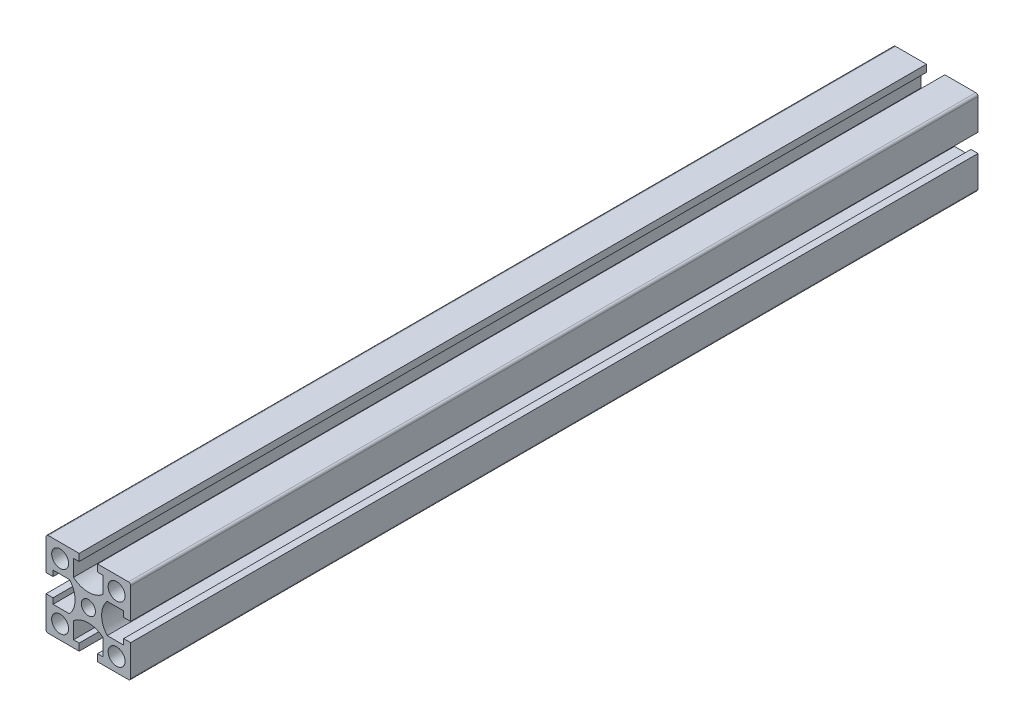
ISO-10303-21;
HEADER;
FILE_DESCRIPTION(('STEP AP214'),'2;1');
FILE_NAME('part.step','',(''),(''),'','','');
FILE_SCHEMA(('AUTOMOTIVE_DESIGN { 1 0 10303 214 1 1 1 1 }'));
ENDSEC;
DATA;
#1=APPLICATION_CONTEXT('core data for automotive mechanical design processes');
#2=APPLICATION_PROTOCOL_DEFINITION('international standard','automotive_design',2000,#1);
#3=PRODUCT_CONTEXT('',#1,'mechanical');
#4=PRODUCT('Part','Part','',(#3));
#5=PRODUCT_RELATED_PRODUCT_CATEGORY('part','',(#4));
#6=PRODUCT_DEFINITION_FORMATION('','',#4);
#7=PRODUCT_DEFINITION_CONTEXT('part definition',#1,'design');
#8=PRODUCT_DEFINITION('design','',#6,#7);
#9=PRODUCT_DEFINITION_SHAPE('','',#8);
#10=(LENGTH_UNIT() NAMED_UNIT(*) SI_UNIT(.MILLI.,.METRE.));
#11=(NAMED_UNIT(*) PLANE_ANGLE_UNIT() SI_UNIT($,.RADIAN.));
#12=(NAMED_UNIT(*) SI_UNIT($,.STERADIAN.) SOLID_ANGLE_UNIT());
#13=UNCERTAINTY_MEASURE_WITH_UNIT(LENGTH_MEASURE(1.E-05),#10,'distance_accuracy_value','');
#14=(GEOMETRIC_REPRESENTATION_CONTEXT(3) GLOBAL_UNCERTAINTY_ASSIGNED_CONTEXT((#13)) GLOBAL_UNIT_ASSIGNED_CONTEXT((#10,
#11,#12)) REPRESENTATION_CONTEXT('',''));
#15=CARTESIAN_POINT('',(0.,0.,0.));
#16=DIRECTION('',(0.,0.,1.));
#17=DIRECTION('',(1.,0.,0.));
#18=AXIS2_PLACEMENT_3D('',#15,#16,#17);
#19=CARTESIAN_POINT('',(-14.1999999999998,14.1999999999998,150.));
#20=DIRECTION('',(0.,0.,1.));
#21=DIRECTION('',(1.,0.,0.));
#22=AXIS2_PLACEMENT_3D('',#19,#20,#21);
#23=PLANE('',#22);
#24=CARTESIAN_POINT('',(-10.,10.,150.));
#25=DIRECTION('',(0.,0.,1.));
#26=DIRECTION('',(1.,0.,0.));
#27=AXIS2_PLACEMENT_3D('',#24,#25,#26);
#28=CIRCLE('',#27,3.);
#29=CARTESIAN_POINT('',(-7.,10.,150.));
#30=VERTEX_POINT('',#29);
#31=EDGE_CURVE('E661',#30,#30,#28,.T.);
#32=ORIENTED_EDGE('',*,*,#31,.F.);
#33=EDGE_LOOP('',(#32));
#34=FACE_BOUND('',#33,.T.);
#35=CARTESIAN_POINT('',(10.,10.,150.));
#36=DIRECTION('',(0.,0.,1.));
#37=DIRECTION('',(1.,0.,0.));
#38=AXIS2_PLACEMENT_3D('',#35,#36,#37);
#39=CIRCLE('',#38,3.);
#40=CARTESIAN_POINT('',(13.,10.,150.));
#41=VERTEX_POINT('',#40);
#42=EDGE_CURVE('E674',#41,#41,#39,.T.);
#43=ORIENTED_EDGE('',*,*,#42,.F.);
#44=EDGE_LOOP('',(#43));
#45=FACE_BOUND('',#44,.T.);
#46=CARTESIAN_POINT('',(-14.1999999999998,14.1999999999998,150.));
#47=DIRECTION('',(0.,0.,1.));
#48=DIRECTION('',(1.,0.,0.));
#49=AXIS2_PLACEMENT_3D('',#46,#47,#48);
#50=CIRCLE('',#49,0.800000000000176);
#51=CARTESIAN_POINT('',(-14.1999999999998,15.,150.));
#52=VERTEX_POINT('',#51);
#53=CARTESIAN_POINT('',(-15.,14.1999999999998,150.));
#54=VERTEX_POINT('',#53);
#55=EDGE_CURVE('E403',#52,#54,#50,.T.);
#56=ORIENTED_EDGE('',*,*,#55,.T.);
#57=DIRECTION('',(0.,-1.,0.));
#58=VECTOR('',#57,1.);
#59=CARTESIAN_POINT('',(-15.,14.1999999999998,150.));
#60=LINE('',#59,#58);
#61=CARTESIAN_POINT('',(-15.,3.25,150.));
#62=VERTEX_POINT('',#61);
#63=EDGE_CURVE('E191',#54,#62,#60,.T.);
#64=ORIENTED_EDGE('',*,*,#63,.T.);
#65=DIRECTION('',(1.,0.,0.));
#66=VECTOR('',#65,1.);
#67=CARTESIAN_POINT('',(-15.,3.25,150.));
#68=LINE('',#67,#66);
#69=CARTESIAN_POINT('',(-12.5,3.25,150.));
#70=VERTEX_POINT('',#69);
#71=EDGE_CURVE('E514',#62,#70,#68,.T.);
#72=ORIENTED_EDGE('',*,*,#71,.T.);
#73=DIRECTION('',(0.,1.,0.));
#74=VECTOR('',#73,1.);
#75=CARTESIAN_POINT('',(-12.5,3.25,150.));
#76=LINE('',#75,#74);
#77=CARTESIAN_POINT('',(-12.5,5.25,150.));
#78=VERTEX_POINT('',#77);
#79=EDGE_CURVE('E533',#70,#78,#76,.T.);
#80=ORIENTED_EDGE('',*,*,#79,.T.);
#81=DIRECTION('',(1.,0.,0.));
#82=VECTOR('',#81,1.);
#83=CARTESIAN_POINT('',(-12.5,5.25,150.));
#84=LINE('',#83,#82);
#85=CARTESIAN_POINT('',(-6.66365176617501,5.25,150.));
#86=VERTEX_POINT('',#85);
#87=EDGE_CURVE('E530',#78,#86,#84,.T.);
#88=ORIENTED_EDGE('',*,*,#87,.T.);
#89=CARTESIAN_POINT('',(-12.6999999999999,0.,150.));
#90=DIRECTION('',(0.,0.,-1.));
#91=DIRECTION('',(1.,0.,0.));
#92=AXIS2_PLACEMENT_3D('',#89,#90,#91);
#93=CIRCLE('',#92,8.00000000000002);
#94=CARTESIAN_POINT('',(-6.66365176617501,-5.25,150.));
#95=VERTEX_POINT('',#94);
#96=EDGE_CURVE('E532',#86,#95,#93,.T.);
#97=ORIENTED_EDGE('',*,*,#96,.T.);
#98=DIRECTION('',(-1.,0.,0.));
#99=VECTOR('',#98,1.);
#100=CARTESIAN_POINT('',(-6.66365176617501,-5.25,150.));
#101=LINE('',#100,#99);
#102=CARTESIAN_POINT('',(-12.5,-5.25,150.));
#103=VERTEX_POINT('',#102);
#104=EDGE_CURVE('E535',#95,#103,#101,.T.);
#105=ORIENTED_EDGE('',*,*,#104,.T.);
#106=DIRECTION('',(0.,1.,0.));
#107=VECTOR('',#106,1.);
#108=CARTESIAN_POINT('',(-12.5,-5.25,150.));
#109=LINE('',#108,#107);
#110=CARTESIAN_POINT('',(-12.5,-3.25,150.));
#111=VERTEX_POINT('',#110);
#112=EDGE_CURVE('E541',#103,#111,#109,.T.);
#113=ORIENTED_EDGE('',*,*,#112,.T.);
#114=DIRECTION('',(-1.,0.,0.));
#115=VECTOR('',#114,1.);
#116=CARTESIAN_POINT('',(-12.5,-3.25,150.));
#117=LINE('',#116,#115);
#118=CARTESIAN_POINT('',(-15.,-3.25,150.));
#119=VERTEX_POINT('',#118);
#120=EDGE_CURVE('E543',#111,#119,#117,.T.);
#121=ORIENTED_EDGE('',*,*,#120,.T.);
#122=DIRECTION('',(0.,-1.,0.));
#123=VECTOR('',#122,1.);
#124=CARTESIAN_POINT('',(-15.,-3.25,150.));
#125=LINE('',#124,#123);
#126=CARTESIAN_POINT('',(-15.,-14.2000000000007,150.));
#127=VERTEX_POINT('',#126);
#128=EDGE_CURVE('E545',#119,#127,#125,.T.);
#129=ORIENTED_EDGE('',*,*,#128,.T.);
#130=CARTESIAN_POINT('',(-14.2000000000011,-14.2000000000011,150.));
#131=DIRECTION('',(0.,0.,1.));
#132=DIRECTION('',(1.,0.,0.));
#133=AXIS2_PLACEMENT_3D('',#130,#131,#132);
#134=CIRCLE('',#133,0.799999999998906);
#135=CARTESIAN_POINT('',(-14.1999999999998,-15.,150.));
#136=VERTEX_POINT('',#135);
#137=EDGE_CURVE('E547',#127,#136,#134,.T.);
#138=ORIENTED_EDGE('',*,*,#137,.T.);
#139=DIRECTION('',(1.,0.,0.));
#140=VECTOR('',#139,1.);
#141=CARTESIAN_POINT('',(-14.1999999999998,-15.,150.));
#142=LINE('',#141,#140);
#143=CARTESIAN_POINT('',(-3.25,-15.,150.));
#144=VERTEX_POINT('',#143);
#145=EDGE_CURVE('E549',#136,#144,#142,.T.);
#146=ORIENTED_EDGE('',*,*,#145,.T.);
#147=DIRECTION('',(0.,1.,0.));
#148=VECTOR('',#147,1.);
#149=CARTESIAN_POINT('',(-3.25,-15.,150.));
#150=LINE('',#149,#148);
#151=CARTESIAN_POINT('',(-3.25,-12.5,150.));
#152=VERTEX_POINT('',#151);
#153=EDGE_CURVE('E551',#144,#152,#150,.T.);
#154=ORIENTED_EDGE('',*,*,#153,.T.);
#155=DIRECTION('',(-1.,0.,0.));
#156=VECTOR('',#155,1.);
#157=CARTESIAN_POINT('',(-3.25,-12.5,150.));
#158=LINE('',#157,#156);
#159=CARTESIAN_POINT('',(-5.25,-12.5,150.));
#160=VERTEX_POINT('',#159);
#161=EDGE_CURVE('E553',#152,#160,#158,.T.);
#162=ORIENTED_EDGE('',*,*,#161,.T.);
#163=DIRECTION('',(0.,1.,0.));
#164=VECTOR('',#163,1.);
#165=CARTESIAN_POINT('',(-5.25,-12.5,150.));
#166=LINE('',#165,#164);
#167=CARTESIAN_POINT('',(-5.25,-6.66365176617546,150.));
#168=VERTEX_POINT('',#167);
#169=EDGE_CURVE('E555',#160,#168,#166,.T.);
#170=ORIENTED_EDGE('',*,*,#169,.T.);
#171=CARTESIAN_POINT('',(0.,-12.7000000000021,150.));
#172=DIRECTION('',(0.,0.,-1.));
#173=DIRECTION('',(1.,0.,0.));
#174=AXIS2_PLACEMENT_3D('',#171,#172,#173);
#175=CIRCLE('',#174,8.00000000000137);
#176=CARTESIAN_POINT('',(5.25,-6.66365176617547,150.));
#177=VERTEX_POINT('',#176);
#178=EDGE_CURVE('E557',#168,#177,#175,.T.);
#179=ORIENTED_EDGE('',*,*,#178,.T.);
#180=DIRECTION('',(0.,-1.,0.));
#181=VECTOR('',#180,1.);
#182=CARTESIAN_POINT('',(5.25,-6.66365176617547,150.));
#183=LINE('',#182,#181);
#184=CARTESIAN_POINT('',(5.25,-12.5,150.));
#185=VERTEX_POINT('',#184);
#186=EDGE_CURVE('E559',#177,#185,#183,.T.);
#187=ORIENTED_EDGE('',*,*,#186,.T.);
#188=DIRECTION('',(-1.,0.,0.));
#189=VECTOR('',#188,1.);
#190=CARTESIAN_POINT('',(5.25,-12.5,150.));
#191=LINE('',#190,#189);
#192=CARTESIAN_POINT('',(3.25,-12.5,150.));
#193=VERTEX_POINT('',#192);
#194=EDGE_CURVE('E561',#185,#193,#191,.T.);
#195=ORIENTED_EDGE('',*,*,#194,.T.);
#196=DIRECTION('',(0.,-1.,0.));
#197=VECTOR('',#196,1.);
#198=CARTESIAN_POINT('',(3.25,-12.5,150.));
#199=LINE('',#198,#197);
#200=CARTESIAN_POINT('',(3.25,-15.,150.));
#201=VERTEX_POINT('',#200);
#202=EDGE_CURVE('E563',#193,#201,#199,.T.);
#203=ORIENTED_EDGE('',*,*,#202,.T.);
#204=DIRECTION('',(1.,0.,0.));
#205=VECTOR('',#204,1.);
#206=CARTESIAN_POINT('',(3.25,-15.,150.));
#207=LINE('',#206,#205);
#208=CARTESIAN_POINT('',(14.2000000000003,-15.,150.));
#209=VERTEX_POINT('',#208);
#210=EDGE_CURVE('E565',#201,#209,#207,.T.);
#211=ORIENTED_EDGE('',*,*,#210,.T.);
#212=CARTESIAN_POINT('',(14.2000000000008,-14.2000000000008,150.));
#213=DIRECTION('',(0.,0.,1.));
#214=DIRECTION('',(1.,0.,0.));
#215=AXIS2_PLACEMENT_3D('',#212,#213,#214);
#216=CIRCLE('',#215,0.799999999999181);
#217=CARTESIAN_POINT('',(15.,-14.1999999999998,150.));
#218=VERTEX_POINT('',#217);
#219=EDGE_CURVE('E567',#209,#218,#216,.T.);
#220=ORIENTED_EDGE('',*,*,#219,.T.);
#221=DIRECTION('',(0.,1.,0.));
#222=VECTOR('',#221,1.);
#223=CARTESIAN_POINT('',(15.,-14.1999999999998,150.));
#224=LINE('',#223,#222);
#225=CARTESIAN_POINT('',(15.,-3.25,150.));
#226=VERTEX_POINT('',#225);
#227=EDGE_CURVE('E569',#218,#226,#224,.T.);
#228=ORIENTED_EDGE('',*,*,#227,.T.);
#229=DIRECTION('',(-1.,0.,0.));
#230=VECTOR('',#229,1.);
#231=CARTESIAN_POINT('',(15.,-3.25,150.));
#232=LINE('',#231,#230);
#233=CARTESIAN_POINT('',(12.5,-3.25,150.));
#234=VERTEX_POINT('',#233);
#235=EDGE_CURVE('E571',#226,#234,#232,.T.);
#236=ORIENTED_EDGE('',*,*,#235,.T.);
#237=DIRECTION('',(0.,-1.,0.));
#238=VECTOR('',#237,1.);
#239=CARTESIAN_POINT('',(12.5,-3.25,150.));
#240=LINE('',#239,#238);
#241=CARTESIAN_POINT('',(12.5,-5.25,150.));
#242=VERTEX_POINT('',#241);
#243=EDGE_CURVE('E573',#234,#242,#240,.T.);
#244=ORIENTED_EDGE('',*,*,#243,.T.);
#245=DIRECTION('',(-1.,0.,0.));
#246=VECTOR('',#245,1.);
#247=CARTESIAN_POINT('',(12.5,-5.25,150.));
#248=LINE('',#247,#246);
#249=CARTESIAN_POINT('',(6.66365176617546,-5.25,150.));
#250=VERTEX_POINT('',#249);
#251=EDGE_CURVE('E575',#242,#250,#248,.T.);
#252=ORIENTED_EDGE('',*,*,#251,.T.);
#253=CARTESIAN_POINT('',(12.7000000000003,0.,150.));
#254=DIRECTION('',(0.,0.,-1.));
#255=DIRECTION('',(1.,0.,0.));
#256=AXIS2_PLACEMENT_3D('',#253,#254,#255);
#257=CIRCLE('',#256,8.00000000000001);
#258=CARTESIAN_POINT('',(6.66365176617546,5.25,150.));
#259=VERTEX_POINT('',#258);
#260=EDGE_CURVE('E577',#250,#259,#257,.T.);
#261=ORIENTED_EDGE('',*,*,#260,.T.);
#262=DIRECTION('',(1.,0.,0.));
#263=VECTOR('',#262,1.);
#264=CARTESIAN_POINT('',(6.66365176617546,5.25,150.));
#265=LINE('',#264,#263);
#266=CARTESIAN_POINT('',(12.5,5.25,150.));
#267=VERTEX_POINT('',#266);
#268=EDGE_CURVE('E579',#259,#267,#265,.T.);
#269=ORIENTED_EDGE('',*,*,#268,.T.);
#270=DIRECTION('',(0.,-1.,0.));
#271=VECTOR('',#270,1.);
#272=CARTESIAN_POINT('',(12.5,5.25,150.));
#273=LINE('',#272,#271);
#274=CARTESIAN_POINT('',(12.5,3.25,150.));
#275=VERTEX_POINT('',#274);
#276=EDGE_CURVE('E581',#267,#275,#273,.T.);
#277=ORIENTED_EDGE('',*,*,#276,.T.);
#278=DIRECTION('',(1.,0.,0.));
#279=VECTOR('',#278,1.);
#280=CARTESIAN_POINT('',(12.5,3.25,150.));
#281=LINE('',#280,#279);
#282=CARTESIAN_POINT('',(15.,3.25,150.));
#283=VERTEX_POINT('',#282);
#284=EDGE_CURVE('E583',#275,#283,#281,.T.);
#285=ORIENTED_EDGE('',*,*,#284,.T.);
#286=DIRECTION('',(0.,1.,0.));
#287=VECTOR('',#286,1.);
#288=CARTESIAN_POINT('',(15.,3.25,150.));
#289=LINE('',#288,#287);
#290=CARTESIAN_POINT('',(15.,14.1999999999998,150.));
#291=VERTEX_POINT('',#290);
#292=EDGE_CURVE('E585',#283,#291,#289,.T.);
#293=ORIENTED_EDGE('',*,*,#292,.T.);
#294=CARTESIAN_POINT('',(14.1999999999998,14.1999999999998,150.));
#295=DIRECTION('',(0.,0.,1.));
#296=DIRECTION('',(1.,0.,0.));
#297=AXIS2_PLACEMENT_3D('',#294,#295,#296);
#298=CIRCLE('',#297,0.800000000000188);
#299=CARTESIAN_POINT('',(14.1999999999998,15.,150.));
#300=VERTEX_POINT('',#299);
#301=EDGE_CURVE('E587',#291,#300,#298,.T.);
#302=ORIENTED_EDGE('',*,*,#301,.T.);
#303=DIRECTION('',(-1.,0.,0.));
#304=VECTOR('',#303,1.);
#305=CARTESIAN_POINT('',(14.1999999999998,15.,150.));
#306=LINE('',#305,#304);
#307=CARTESIAN_POINT('',(3.25,15.,150.));
#308=VERTEX_POINT('',#307);
#309=EDGE_CURVE('E589',#300,#308,#306,.T.);
#310=ORIENTED_EDGE('',*,*,#309,.T.);
#311=DIRECTION('',(0.,-1.,0.));
#312=VECTOR('',#311,1.);
#313=CARTESIAN_POINT('',(3.25,15.,150.));
#314=LINE('',#313,#312);
#315=CARTESIAN_POINT('',(3.25,12.5,150.));
#316=VERTEX_POINT('',#315);
#317=EDGE_CURVE('E591',#308,#316,#314,.T.);
#318=ORIENTED_EDGE('',*,*,#317,.T.);
#319=DIRECTION('',(1.,0.,0.));
#320=VECTOR('',#319,1.);
#321=CARTESIAN_POINT('',(3.25,12.5,150.));
#322=LINE('',#321,#320);
#323=CARTESIAN_POINT('',(5.25,12.5,150.));
#324=VERTEX_POINT('',#323);
#325=EDGE_CURVE('E593',#316,#324,#322,.T.);
#326=ORIENTED_EDGE('',*,*,#325,.T.);
#327=DIRECTION('',(0.,-1.,0.));
#328=VECTOR('',#327,1.);
#329=CARTESIAN_POINT('',(5.25,12.5,150.));
#330=LINE('',#329,#328);
#331=CARTESIAN_POINT('',(5.25,6.66365176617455,150.));
#332=VERTEX_POINT('',#331);
#333=EDGE_CURVE('E595',#324,#332,#330,.T.);
#334=ORIENTED_EDGE('',*,*,#333,.T.);
#335=CARTESIAN_POINT('',(0.,12.7000000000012,150.));
#336=DIRECTION('',(0.,0.,-1.));
#337=DIRECTION('',(1.,0.,0.));
#338=AXIS2_PLACEMENT_3D('',#335,#336,#337);
#339=CIRCLE('',#338,8.00000000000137);
#340=CARTESIAN_POINT('',(-5.25,6.66365176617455,150.));
#341=VERTEX_POINT('',#340);
#342=EDGE_CURVE('E597',#332,#341,#339,.T.);
#343=ORIENTED_EDGE('',*,*,#342,.T.);
#344=DIRECTION('',(0.,1.,0.));
#345=VECTOR('',#344,1.);
#346=CARTESIAN_POINT('',(-5.25,6.66365176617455,150.));
#347=LINE('',#346,#345);
#348=CARTESIAN_POINT('',(-5.25,12.5,150.));
#349=VERTEX_POINT('',#348);
#350=EDGE_CURVE('E306',#341,#349,#347,.T.);
#351=ORIENTED_EDGE('',*,*,#350,.T.);
#352=DIRECTION('',(1.,0.,0.));
#353=VECTOR('',#352,1.);
#354=CARTESIAN_POINT('',(-5.25,12.5,150.));
#355=LINE('',#354,#353);
#356=CARTESIAN_POINT('',(-3.25,12.5,150.));
#357=VERTEX_POINT('',#356);
#358=EDGE_CURVE('E300',#349,#357,#355,.T.);
#359=ORIENTED_EDGE('',*,*,#358,.T.);
#360=DIRECTION('',(0.,1.,0.));
#361=VECTOR('',#360,1.);
#362=CARTESIAN_POINT('',(-3.25,12.5,150.));
#363=LINE('',#362,#361);
#364=CARTESIAN_POINT('',(-3.25,15.,150.));
#365=VERTEX_POINT('',#364);
#366=EDGE_CURVE('E304',#357,#365,#363,.T.);
#367=ORIENTED_EDGE('',*,*,#366,.T.);
#368=DIRECTION('',(-1.,0.,0.));
#369=VECTOR('',#368,1.);
#370=CARTESIAN_POINT('',(-3.25,15.,150.));
#371=LINE('',#370,#369);
#372=EDGE_CURVE('E52',#365,#52,#371,.T.);
#373=ORIENTED_EDGE('',*,*,#372,.T.);
#374=EDGE_LOOP('',(#56,#64,#72,#80,#88,#97,#105,#113,#121,#129,#138,#146,#154,#162,#170,#179,
#187,#195,#203,#211,#220,#228,#236,#244,#252,#261,#269,#277,#285,#293,#302,#310,#318,#326,#334,
#343,#351,#359,#367,#373));
#375=FACE_BOUND('',#374,.T.);
#376=CARTESIAN_POINT('',(10.,-10.,150.));
#377=DIRECTION('',(0.,0.,1.));
#378=DIRECTION('',(1.,0.,0.));
#379=AXIS2_PLACEMENT_3D('',#376,#377,#378);
#380=CIRCLE('',#379,3.);
#381=CARTESIAN_POINT('',(13.,-10.,150.));
#382=VERTEX_POINT('',#381);
#383=EDGE_CURVE('E328',#382,#382,#380,.T.);
#384=ORIENTED_EDGE('',*,*,#383,.F.);
#385=EDGE_LOOP('',(#384));
#386=FACE_BOUND('',#385,.T.);
#387=CARTESIAN_POINT('',(-10.,-10.,150.));
#388=DIRECTION('',(0.,0.,1.));
#389=DIRECTION('',(1.,0.,0.));
#390=AXIS2_PLACEMENT_3D('',#387,#388,#389);
#391=CIRCLE('',#390,3.);
#392=CARTESIAN_POINT('',(-7.,-10.,150.));
#393=VERTEX_POINT('',#392);
#394=EDGE_CURVE('E668',#393,#393,#391,.T.);
#395=ORIENTED_EDGE('',*,*,#394,.F.);
#396=EDGE_LOOP('',(#395));
#397=FACE_BOUND('',#396,.T.);
#398=CARTESIAN_POINT('',(0.,0.,150.));
#399=DIRECTION('',(0.,0.,1.));
#400=DIRECTION('',(1.,0.,0.));
#401=AXIS2_PLACEMENT_3D('',#398,#399,#400);
#402=CIRCLE('',#401,2.5);
#403=CARTESIAN_POINT('',(2.5,0.,150.));
#404=VERTEX_POINT('',#403);
#405=EDGE_CURVE('E656',#404,#404,#402,.T.);
#406=ORIENTED_EDGE('',*,*,#405,.F.);
#407=EDGE_LOOP('',(#406));
#408=FACE_BOUND('',#407,.T.);
#409=ADVANCED_FACE('F35',(#34,#45,#375,#386,#397,#408),#23,.T.);
#410=CARTESIAN_POINT('',(-14.1999999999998,14.1999999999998,-150.));
#411=DIRECTION('',(0.,0.,1.));
#412=DIRECTION('',(1.,0.,0.));
#413=AXIS2_PLACEMENT_3D('',#410,#411,#412);
#414=PLANE('',#413);
#415=CARTESIAN_POINT('',(-10.,10.,-150.));
#416=DIRECTION('',(0.,0.,1.));
#417=DIRECTION('',(1.,0.,0.));
#418=AXIS2_PLACEMENT_3D('',#415,#416,#417);
#419=CIRCLE('',#418,3.);
#420=CARTESIAN_POINT('',(-7.,10.,-150.));
#421=VERTEX_POINT('',#420);
#422=EDGE_CURVE('E658',#421,#421,#419,.T.);
#423=ORIENTED_EDGE('',*,*,#422,.T.);
#424=EDGE_LOOP('',(#423));
#425=FACE_BOUND('',#424,.T.);
#426=CARTESIAN_POINT('',(10.,10.,-150.));
#427=DIRECTION('',(0.,0.,1.));
#428=DIRECTION('',(1.,0.,0.));
#429=AXIS2_PLACEMENT_3D('',#426,#427,#428);
#430=CIRCLE('',#429,3.);
#431=CARTESIAN_POINT('',(13.,10.,-150.));
#432=VERTEX_POINT('',#431);
#433=EDGE_CURVE('E671',#432,#432,#430,.T.);
#434=ORIENTED_EDGE('',*,*,#433,.T.);
#435=EDGE_LOOP('',(#434));
#436=FACE_BOUND('',#435,.T.);
#437=CARTESIAN_POINT('',(-14.1999999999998,14.1999999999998,-150.));
#438=DIRECTION('',(0.,0.,1.));
#439=DIRECTION('',(1.,0.,0.));
#440=AXIS2_PLACEMENT_3D('',#437,#438,#439);
#441=CIRCLE('',#440,0.800000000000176);
#442=CARTESIAN_POINT('',(-14.1999999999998,15.,-150.));
#443=VERTEX_POINT('',#442);
#444=CARTESIAN_POINT('',(-15.,14.1999999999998,-150.));
#445=VERTEX_POINT('',#444);
#446=EDGE_CURVE('E324',#443,#445,#441,.T.);
#447=ORIENTED_EDGE('',*,*,#446,.F.);
#448=DIRECTION('',(-1.,0.,0.));
#449=VECTOR('',#448,1.);
#450=CARTESIAN_POINT('',(-3.25,15.,-150.));
#451=LINE('',#450,#449);
#452=CARTESIAN_POINT('',(-3.25,15.,-150.));
#453=VERTEX_POINT('',#452);
#454=EDGE_CURVE('E183',#453,#443,#451,.T.);
#455=ORIENTED_EDGE('',*,*,#454,.F.);
#456=DIRECTION('',(0.,1.,0.));
#457=VECTOR('',#456,1.);
#458=CARTESIAN_POINT('',(-3.25,12.5,-150.));
#459=LINE('',#458,#457);
#460=CARTESIAN_POINT('',(-3.25,12.5,-150.));
#461=VERTEX_POINT('',#460);
#462=EDGE_CURVE('E177',#461,#453,#459,.T.);
#463=ORIENTED_EDGE('',*,*,#462,.F.);
#464=DIRECTION('',(1.,0.,0.));
#465=VECTOR('',#464,1.);
#466=CARTESIAN_POINT('',(-5.25,12.5,-150.));
#467=LINE('',#466,#465);
#468=CARTESIAN_POINT('',(-5.25,12.5,-150.));
#469=VERTEX_POINT('',#468);
#470=EDGE_CURVE('E314',#469,#461,#467,.T.);
#471=ORIENTED_EDGE('',*,*,#470,.F.);
#472=DIRECTION('',(0.,1.,0.));
#473=VECTOR('',#472,1.);
#474=CARTESIAN_POINT('',(-5.25,6.66365176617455,-150.));
#475=LINE('',#474,#473);
#476=CARTESIAN_POINT('',(-5.25,6.66365176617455,-150.));
#477=VERTEX_POINT('',#476);
#478=EDGE_CURVE('E398',#477,#469,#475,.T.);
#479=ORIENTED_EDGE('',*,*,#478,.F.);
#480=CARTESIAN_POINT('',(0.,12.7000000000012,-150.));
#481=DIRECTION('',(0.,0.,-1.));
#482=DIRECTION('',(1.,0.,0.));
#483=AXIS2_PLACEMENT_3D('',#480,#481,#482);
#484=CIRCLE('',#483,8.00000000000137);
#485=CARTESIAN_POINT('',(5.25,6.66365176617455,-150.));
#486=VERTEX_POINT('',#485);
#487=EDGE_CURVE('E396',#486,#477,#484,.T.);
#488=ORIENTED_EDGE('',*,*,#487,.F.);
#489=DIRECTION('',(0.,-1.,0.));
#490=VECTOR('',#489,1.);
#491=CARTESIAN_POINT('',(5.25,12.5,-150.));
#492=LINE('',#491,#490);
#493=CARTESIAN_POINT('',(5.25,12.5,-150.));
#494=VERTEX_POINT('',#493);
#495=EDGE_CURVE('E394',#494,#486,#492,.T.);
#496=ORIENTED_EDGE('',*,*,#495,.F.);
#497=DIRECTION('',(1.,0.,0.));
#498=VECTOR('',#497,1.);
#499=CARTESIAN_POINT('',(3.25,12.5,-150.));
#500=LINE('',#499,#498);
#501=CARTESIAN_POINT('',(3.25,12.5,-150.));
#502=VERTEX_POINT('',#501);
#503=EDGE_CURVE('E392',#502,#494,#500,.T.);
#504=ORIENTED_EDGE('',*,*,#503,.F.);
#505=DIRECTION('',(0.,-1.,0.));
#506=VECTOR('',#505,1.);
#507=CARTESIAN_POINT('',(3.25,15.,-150.));
#508=LINE('',#507,#506);
#509=CARTESIAN_POINT('',(3.25,15.,-150.));
#510=VERTEX_POINT('',#509);
#511=EDGE_CURVE('E390',#510,#502,#508,.T.);
#512=ORIENTED_EDGE('',*,*,#511,.F.);
#513=DIRECTION('',(-1.,0.,0.));
#514=VECTOR('',#513,1.);
#515=CARTESIAN_POINT('',(14.1999999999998,15.,-150.));
#516=LINE('',#515,#514);
#517=CARTESIAN_POINT('',(14.1999999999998,15.,-150.));
#518=VERTEX_POINT('',#517);
#519=EDGE_CURVE('E388',#518,#510,#516,.T.);
#520=ORIENTED_EDGE('',*,*,#519,.F.);
#521=CARTESIAN_POINT('',(14.1999999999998,14.1999999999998,-150.));
#522=DIRECTION('',(0.,0.,1.));
#523=DIRECTION('',(1.,0.,0.));
#524=AXIS2_PLACEMENT_3D('',#521,#522,#523);
#525=CIRCLE('',#524,0.800000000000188);
#526=CARTESIAN_POINT('',(15.,14.1999999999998,-150.));
#527=VERTEX_POINT('',#526);
#528=EDGE_CURVE('E386',#527,#518,#525,.T.);
#529=ORIENTED_EDGE('',*,*,#528,.F.);
#530=DIRECTION('',(0.,1.,0.));
#531=VECTOR('',#530,1.);
#532=CARTESIAN_POINT('',(15.,3.25,-150.));
#533=LINE('',#532,#531);
#534=CARTESIAN_POINT('',(15.,3.25,-150.));
#535=VERTEX_POINT('',#534);
#536=EDGE_CURVE('E384',#535,#527,#533,.T.);
#537=ORIENTED_EDGE('',*,*,#536,.F.);
#538=DIRECTION('',(1.,0.,0.));
#539=VECTOR('',#538,1.);
#540=CARTESIAN_POINT('',(12.5,3.25,-150.));
#541=LINE('',#540,#539);
#542=CARTESIAN_POINT('',(12.5,3.25,-150.));
#543=VERTEX_POINT('',#542);
#544=EDGE_CURVE('E382',#543,#535,#541,.T.);
#545=ORIENTED_EDGE('',*,*,#544,.F.);
#546=DIRECTION('',(0.,-1.,0.));
#547=VECTOR('',#546,1.);
#548=CARTESIAN_POINT('',(12.5,5.25,-150.));
#549=LINE('',#548,#547);
#550=CARTESIAN_POINT('',(12.5,5.25,-150.));
#551=VERTEX_POINT('',#550);
#552=EDGE_CURVE('E380',#551,#543,#549,.T.);
#553=ORIENTED_EDGE('',*,*,#552,.F.);
#554=DIRECTION('',(1.,0.,0.));
#555=VECTOR('',#554,1.);
#556=CARTESIAN_POINT('',(6.66365176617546,5.25,-150.));
#557=LINE('',#556,#555);
#558=CARTESIAN_POINT('',(6.66365176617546,5.25,-150.));
#559=VERTEX_POINT('',#558);
#560=EDGE_CURVE('E378',#559,#551,#557,.T.);
#561=ORIENTED_EDGE('',*,*,#560,.F.);
#562=CARTESIAN_POINT('',(12.7000000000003,0.,-150.));
#563=DIRECTION('',(0.,0.,-1.));
#564=DIRECTION('',(1.,0.,0.));
#565=AXIS2_PLACEMENT_3D('',#562,#563,#564);
#566=CIRCLE('',#565,8.00000000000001);
#567=CARTESIAN_POINT('',(6.66365176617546,-5.25,-150.));
#568=VERTEX_POINT('',#567);
#569=EDGE_CURVE('E376',#568,#559,#566,.T.);
#570=ORIENTED_EDGE('',*,*,#569,.F.);
#571=DIRECTION('',(-1.,0.,0.));
#572=VECTOR('',#571,1.);
#573=CARTESIAN_POINT('',(12.5,-5.25,-150.));
#574=LINE('',#573,#572);
#575=CARTESIAN_POINT('',(12.5,-5.25,-150.));
#576=VERTEX_POINT('',#575);
#577=EDGE_CURVE('E374',#576,#568,#574,.T.);
#578=ORIENTED_EDGE('',*,*,#577,.F.);
#579=DIRECTION('',(0.,-1.,0.));
#580=VECTOR('',#579,1.);
#581=CARTESIAN_POINT('',(12.5,-3.25,-150.));
#582=LINE('',#581,#580);
#583=CARTESIAN_POINT('',(12.5,-3.25,-150.));
#584=VERTEX_POINT('',#583);
#585=EDGE_CURVE('E372',#584,#576,#582,.T.);
#586=ORIENTED_EDGE('',*,*,#585,.F.);
#587=DIRECTION('',(-1.,0.,0.));
#588=VECTOR('',#587,1.);
#589=CARTESIAN_POINT('',(15.,-3.25,-150.));
#590=LINE('',#589,#588);
#591=CARTESIAN_POINT('',(15.,-3.25,-150.));
#592=VERTEX_POINT('',#591);
#593=EDGE_CURVE('E370',#592,#584,#590,.T.);
#594=ORIENTED_EDGE('',*,*,#593,.F.);
#595=DIRECTION('',(0.,1.,0.));
#596=VECTOR('',#595,1.);
#597=CARTESIAN_POINT('',(15.,-14.1999999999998,-150.));
#598=LINE('',#597,#596);
#599=CARTESIAN_POINT('',(15.,-14.1999999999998,-150.));
#600=VERTEX_POINT('',#599);
#601=EDGE_CURVE('E368',#600,#592,#598,.T.);
#602=ORIENTED_EDGE('',*,*,#601,.F.);
#603=CARTESIAN_POINT('',(14.2000000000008,-14.2000000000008,-150.));
#604=DIRECTION('',(0.,0.,1.));
#605=DIRECTION('',(1.,0.,0.));
#606=AXIS2_PLACEMENT_3D('',#603,#604,#605);
#607=CIRCLE('',#606,0.799999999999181);
#608=CARTESIAN_POINT('',(14.2000000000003,-15.,-150.));
#609=VERTEX_POINT('',#608);
#610=EDGE_CURVE('E366',#609,#600,#607,.T.);
#611=ORIENTED_EDGE('',*,*,#610,.F.);
#612=DIRECTION('',(1.,0.,0.));
#613=VECTOR('',#612,1.);
#614=CARTESIAN_POINT('',(3.25,-15.,-150.));
#615=LINE('',#614,#613);
#616=CARTESIAN_POINT('',(3.25,-15.,-150.));
#617=VERTEX_POINT('',#616);
#618=EDGE_CURVE('E364',#617,#609,#615,.T.);
#619=ORIENTED_EDGE('',*,*,#618,.F.);
#620=DIRECTION('',(0.,-1.,0.));
#621=VECTOR('',#620,1.);
#622=CARTESIAN_POINT('',(3.25,-12.5,-150.));
#623=LINE('',#622,#621);
#624=CARTESIAN_POINT('',(3.25,-12.5,-150.));
#625=VERTEX_POINT('',#624);
#626=EDGE_CURVE('E362',#625,#617,#623,.T.);
#627=ORIENTED_EDGE('',*,*,#626,.F.);
#628=DIRECTION('',(-1.,0.,0.));
#629=VECTOR('',#628,1.);
#630=CARTESIAN_POINT('',(5.25,-12.5,-150.));
#631=LINE('',#630,#629);
#632=CARTESIAN_POINT('',(5.25,-12.5,-150.));
#633=VERTEX_POINT('',#632);
#634=EDGE_CURVE('E360',#633,#625,#631,.T.);
#635=ORIENTED_EDGE('',*,*,#634,.F.);
#636=DIRECTION('',(0.,-1.,0.));
#637=VECTOR('',#636,1.);
#638=CARTESIAN_POINT('',(5.25,-6.66365176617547,-150.));
#639=LINE('',#638,#637);
#640=CARTESIAN_POINT('',(5.25,-6.66365176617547,-150.));
#641=VERTEX_POINT('',#640);
#642=EDGE_CURVE('E358',#641,#633,#639,.T.);
#643=ORIENTED_EDGE('',*,*,#642,.F.);
#644=CARTESIAN_POINT('',(0.,-12.7000000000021,-150.));
#645=DIRECTION('',(0.,0.,-1.));
#646=DIRECTION('',(1.,0.,0.));
#647=AXIS2_PLACEMENT_3D('',#644,#645,#646);
#648=CIRCLE('',#647,8.00000000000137);
#649=CARTESIAN_POINT('',(-5.25,-6.66365176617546,-150.));
#650=VERTEX_POINT('',#649);
#651=EDGE_CURVE('E356',#650,#641,#648,.T.);
#652=ORIENTED_EDGE('',*,*,#651,.F.);
#653=DIRECTION('',(0.,1.,0.));
#654=VECTOR('',#653,1.);
#655=CARTESIAN_POINT('',(-5.25,-12.5,-150.));
#656=LINE('',#655,#654);
#657=CARTESIAN_POINT('',(-5.25,-12.5,-150.));
#658=VERTEX_POINT('',#657);
#659=EDGE_CURVE('E354',#658,#650,#656,.T.);
#660=ORIENTED_EDGE('',*,*,#659,.F.);
#661=DIRECTION('',(-1.,0.,0.));
#662=VECTOR('',#661,1.);
#663=CARTESIAN_POINT('',(-3.25,-12.5,-150.));
#664=LINE('',#663,#662);
#665=CARTESIAN_POINT('',(-3.25,-12.5,-150.));
#666=VERTEX_POINT('',#665);
#667=EDGE_CURVE('E352',#666,#658,#664,.T.);
#668=ORIENTED_EDGE('',*,*,#667,.F.);
#669=DIRECTION('',(0.,1.,0.));
#670=VECTOR('',#669,1.);
#671=CARTESIAN_POINT('',(-3.25,-15.,-150.));
#672=LINE('',#671,#670);
#673=CARTESIAN_POINT('',(-3.25,-15.,-150.));
#674=VERTEX_POINT('',#673);
#675=EDGE_CURVE('E350',#674,#666,#672,.T.);
#676=ORIENTED_EDGE('',*,*,#675,.F.);
#677=DIRECTION('',(1.,0.,0.));
#678=VECTOR('',#677,1.);
#679=CARTESIAN_POINT('',(-14.1999999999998,-15.,-150.));
#680=LINE('',#679,#678);
#681=CARTESIAN_POINT('',(-14.1999999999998,-15.,-150.));
#682=VERTEX_POINT('',#681);
#683=EDGE_CURVE('E348',#682,#674,#680,.T.);
#684=ORIENTED_EDGE('',*,*,#683,.F.);
#685=CARTESIAN_POINT('',(-14.2000000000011,-14.2000000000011,-150.));
#686=DIRECTION('',(0.,0.,1.));
#687=DIRECTION('',(1.,0.,0.));
#688=AXIS2_PLACEMENT_3D('',#685,#686,#687);
#689=CIRCLE('',#688,0.799999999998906);
#690=CARTESIAN_POINT('',(-15.,-14.2000000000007,-150.));
#691=VERTEX_POINT('',#690);
#692=EDGE_CURVE('E346',#691,#682,#689,.T.);
#693=ORIENTED_EDGE('',*,*,#692,.F.);
#694=DIRECTION('',(0.,-1.,0.));
#695=VECTOR('',#694,1.);
#696=CARTESIAN_POINT('',(-15.,-3.25,-150.));
#697=LINE('',#696,#695);
#698=CARTESIAN_POINT('',(-15.,-3.25,-150.));
#699=VERTEX_POINT('',#698);
#700=EDGE_CURVE('E344',#699,#691,#697,.T.);
#701=ORIENTED_EDGE('',*,*,#700,.F.);
#702=DIRECTION('',(-1.,0.,0.));
#703=VECTOR('',#702,1.);
#704=CARTESIAN_POINT('',(-12.5,-3.25,-150.));
#705=LINE('',#704,#703);
#706=CARTESIAN_POINT('',(-12.5,-3.25,-150.));
#707=VERTEX_POINT('',#706);
#708=EDGE_CURVE('E342',#707,#699,#705,.T.);
#709=ORIENTED_EDGE('',*,*,#708,.F.);
#710=DIRECTION('',(0.,1.,0.));
#711=VECTOR('',#710,1.);
#712=CARTESIAN_POINT('',(-12.5,-5.25,-150.));
#713=LINE('',#712,#711);
#714=CARTESIAN_POINT('',(-12.5,-5.25,-150.));
#715=VERTEX_POINT('',#714);
#716=EDGE_CURVE('E340',#715,#707,#713,.T.);
#717=ORIENTED_EDGE('',*,*,#716,.F.);
#718=DIRECTION('',(-1.,0.,0.));
#719=VECTOR('',#718,1.);
#720=CARTESIAN_POINT('',(-6.66365176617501,-5.25,-150.));
#721=LINE('',#720,#719);
#722=CARTESIAN_POINT('',(-6.66365176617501,-5.25,-150.));
#723=VERTEX_POINT('',#722);
#724=EDGE_CURVE('E338',#723,#715,#721,.T.);
#725=ORIENTED_EDGE('',*,*,#724,.F.);
#726=CARTESIAN_POINT('',(-12.6999999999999,0.,-150.));
#727=DIRECTION('',(0.,0.,-1.));
#728=DIRECTION('',(1.,0.,0.));
#729=AXIS2_PLACEMENT_3D('',#726,#727,#728);
#730=CIRCLE('',#729,8.00000000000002);
#731=CARTESIAN_POINT('',(-6.66365176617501,5.25,-150.));
#732=VERTEX_POINT('',#731);
#733=EDGE_CURVE('E336',#732,#723,#730,.T.);
#734=ORIENTED_EDGE('',*,*,#733,.F.);
#735=DIRECTION('',(1.,0.,0.));
#736=VECTOR('',#735,1.);
#737=CARTESIAN_POINT('',(-12.5,5.25,-150.));
#738=LINE('',#737,#736);
#739=CARTESIAN_POINT('',(-12.5,5.25,-150.));
#740=VERTEX_POINT('',#739);
#741=EDGE_CURVE('E334',#740,#732,#738,.T.);
#742=ORIENTED_EDGE('',*,*,#741,.F.);
#743=DIRECTION('',(0.,1.,0.));
#744=VECTOR('',#743,1.);
#745=CARTESIAN_POINT('',(-12.5,3.25,-150.));
#746=LINE('',#745,#744);
#747=CARTESIAN_POINT('',(-12.5,3.25,-150.));
#748=VERTEX_POINT('',#747);
#749=EDGE_CURVE('E332',#748,#740,#746,.T.);
#750=ORIENTED_EDGE('',*,*,#749,.F.);
#751=DIRECTION('',(1.,0.,0.));
#752=VECTOR('',#751,1.);
#753=CARTESIAN_POINT('',(-15.,3.25,-150.));
#754=LINE('',#753,#752);
#755=CARTESIAN_POINT('',(-15.,3.25,-150.));
#756=VERTEX_POINT('',#755);
#757=EDGE_CURVE('E330',#756,#748,#754,.T.);
#758=ORIENTED_EDGE('',*,*,#757,.F.);
#759=DIRECTION('',(0.,-1.,0.));
#760=VECTOR('',#759,1.);
#761=CARTESIAN_POINT('',(-15.,14.1999999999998,-150.));
#762=LINE('',#761,#760);
#763=EDGE_CURVE('E327',#445,#756,#762,.T.);
#764=ORIENTED_EDGE('',*,*,#763,.F.);
#765=EDGE_LOOP('',(#447,#455,#463,#471,#479,#488,#496,#504,#512,#520,#529,#537,#545,#553,#561,
#570,#578,#586,#594,#602,#611,#619,#627,#635,#643,#652,#660,#668,#676,#684,#693,#701,#709,#717,
#725,#734,#742,#750,#758,#764));
#766=FACE_BOUND('',#765,.T.);
#767=CARTESIAN_POINT('',(10.,-10.,-150.));
#768=DIRECTION('',(0.,0.,1.));
#769=DIRECTION('',(1.,0.,0.));
#770=AXIS2_PLACEMENT_3D('',#767,#768,#769);
#771=CIRCLE('',#770,3.);
#772=CARTESIAN_POINT('',(13.,-10.,-150.));
#773=VERTEX_POINT('',#772);
#774=EDGE_CURVE('E677',#773,#773,#771,.T.);
#775=ORIENTED_EDGE('',*,*,#774,.T.);
#776=EDGE_LOOP('',(#775));
#777=FACE_BOUND('',#776,.T.);
#778=CARTESIAN_POINT('',(-10.,-10.,-150.));
#779=DIRECTION('',(0.,0.,1.));
#780=DIRECTION('',(1.,0.,0.));
#781=AXIS2_PLACEMENT_3D('',#778,#779,#780);
#782=CIRCLE('',#781,3.);
#783=CARTESIAN_POINT('',(-7.,-10.,-150.));
#784=VERTEX_POINT('',#783);
#785=EDGE_CURVE('E666',#784,#784,#782,.T.);
#786=ORIENTED_EDGE('',*,*,#785,.T.);
#787=EDGE_LOOP('',(#786));
#788=FACE_BOUND('',#787,.T.);
#789=CARTESIAN_POINT('',(0.,0.,-150.));
#790=DIRECTION('',(0.,0.,1.));
#791=DIRECTION('',(1.,0.,0.));
#792=AXIS2_PLACEMENT_3D('',#789,#790,#791);
#793=CIRCLE('',#792,2.5);
#794=CARTESIAN_POINT('',(2.5,0.,-150.));
#795=VERTEX_POINT('',#794);
#796=EDGE_CURVE('E653',#795,#795,#793,.T.);
#797=ORIENTED_EDGE('',*,*,#796,.T.);
#798=EDGE_LOOP('',(#797));
#799=FACE_BOUND('',#798,.T.);
#800=ADVANCED_FACE('F518',(#425,#436,#766,#777,#788,#799),#414,.F.);
#801=CARTESIAN_POINT('',(-14.1999999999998,14.1999999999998,150.));
#802=DIRECTION('',(0.,0.,-1.));
#803=DIRECTION('',(-1.,0.,0.));
#804=AXIS2_PLACEMENT_3D('',#801,#802,#803);
#805=CYLINDRICAL_SURFACE('',#804,0.800000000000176);
#806=ORIENTED_EDGE('',*,*,#446,.T.);
#807=DIRECTION('',(0.,0.,-1.));
#808=VECTOR('',#807,1.);
#809=CARTESIAN_POINT('',(-15.,14.1999999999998,150.));
#810=LINE('',#809,#808);
#811=EDGE_CURVE('E11',#54,#445,#810,.T.);
#812=ORIENTED_EDGE('',*,*,#811,.F.);
#813=ORIENTED_EDGE('',*,*,#55,.F.);
#814=DIRECTION('',(0.,0.,-1.));
#815=VECTOR('',#814,1.);
#816=CARTESIAN_POINT('',(-14.1999999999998,15.,150.));
#817=LINE('',#816,#815);
#818=EDGE_CURVE('E320',#52,#443,#817,.T.);
#819=ORIENTED_EDGE('',*,*,#818,.T.);
#820=EDGE_LOOP('',(#806,#812,#813,#819));
#821=FACE_BOUND('',#820,.T.);
#822=ADVANCED_FACE('F37',(#821),#805,.T.);
#823=CARTESIAN_POINT('',(-15.,14.1999999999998,150.));
#824=DIRECTION('',(1.,0.,0.));
#825=DIRECTION('',(0.,0.,-1.));
#826=AXIS2_PLACEMENT_3D('',#823,#824,#825);
#827=PLANE('',#826);
#828=ORIENTED_EDGE('',*,*,#763,.T.);
#829=DIRECTION('',(0.,0.,-1.));
#830=VECTOR('',#829,1.);
#831=CARTESIAN_POINT('',(-15.,3.25,150.));
#832=LINE('',#831,#830);
#833=EDGE_CURVE('E44',#62,#756,#832,.T.);
#834=ORIENTED_EDGE('',*,*,#833,.F.);
#835=ORIENTED_EDGE('',*,*,#63,.F.);
#836=ORIENTED_EDGE('',*,*,#811,.T.);
#837=EDGE_LOOP('',(#828,#834,#835,#836));
#838=FACE_BOUND('',#837,.T.);
#839=ADVANCED_FACE('F1077',(#838),#827,.F.);
#840=CARTESIAN_POINT('',(-15.,3.25,150.));
#841=DIRECTION('',(0.,1.,0.));
#842=DIRECTION('',(0.,0.,1.));
#843=AXIS2_PLACEMENT_3D('',#840,#841,#842);
#844=PLANE('',#843);
#845=ORIENTED_EDGE('',*,*,#757,.T.);
#846=DIRECTION('',(0.,0.,-1.));
#847=VECTOR('',#846,1.);
#848=CARTESIAN_POINT('',(-12.5,3.25,150.));
#849=LINE('',#848,#847);
#850=EDGE_CURVE('E506',#70,#748,#849,.T.);
#851=ORIENTED_EDGE('',*,*,#850,.F.);
#852=ORIENTED_EDGE('',*,*,#71,.F.);
#853=ORIENTED_EDGE('',*,*,#833,.T.);
#854=EDGE_LOOP('',(#845,#851,#852,#853));
#855=FACE_BOUND('',#854,.T.);
#856=ADVANCED_FACE('F512',(#855),#844,.F.);
#857=CARTESIAN_POINT('',(-12.5,3.25,150.));
#858=DIRECTION('',(-1.,0.,0.));
#859=DIRECTION('',(0.,0.,1.));
#860=AXIS2_PLACEMENT_3D('',#857,#858,#859);
#861=PLANE('',#860);
#862=ORIENTED_EDGE('',*,*,#749,.T.);
#863=DIRECTION('',(0.,0.,-1.));
#864=VECTOR('',#863,1.);
#865=CARTESIAN_POINT('',(-12.5,5.25,150.));
#866=LINE('',#865,#864);
#867=EDGE_CURVE('E503',#78,#740,#866,.T.);
#868=ORIENTED_EDGE('',*,*,#867,.F.);
#869=ORIENTED_EDGE('',*,*,#79,.F.);
#870=ORIENTED_EDGE('',*,*,#850,.T.);
#871=EDGE_LOOP('',(#862,#868,#869,#870));
#872=FACE_BOUND('',#871,.T.);
#873=ADVANCED_FACE('F524',(#872),#861,.F.);
#874=CARTESIAN_POINT('',(-12.5,5.25,150.));
#875=DIRECTION('',(0.,1.,0.));
#876=DIRECTION('',(0.,0.,1.));
#877=AXIS2_PLACEMENT_3D('',#874,#875,#876);
#878=PLANE('',#877);
#879=ORIENTED_EDGE('',*,*,#741,.T.);
#880=DIRECTION('',(0.,0.,-1.));
#881=VECTOR('',#880,1.);
#882=CARTESIAN_POINT('',(-6.66365176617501,5.25,150.));
#883=LINE('',#882,#881);
#884=EDGE_CURVE('E500',#86,#732,#883,.T.);
#885=ORIENTED_EDGE('',*,*,#884,.F.);
#886=ORIENTED_EDGE('',*,*,#87,.F.);
#887=ORIENTED_EDGE('',*,*,#867,.T.);
#888=EDGE_LOOP('',(#879,#885,#886,#887));
#889=FACE_BOUND('',#888,.T.);
#890=ADVANCED_FACE('F528',(#889),#878,.F.);
#891=CARTESIAN_POINT('',(-12.6999999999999,0.,150.));
#892=DIRECTION('',(0.,0.,-1.));
#893=DIRECTION('',(-1.,0.,0.));
#894=AXIS2_PLACEMENT_3D('',#891,#892,#893);
#895=CYLINDRICAL_SURFACE('',#894,8.00000000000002);
#896=ORIENTED_EDGE('',*,*,#733,.T.);
#897=DIRECTION('',(0.,0.,-1.));
#898=VECTOR('',#897,1.);
#899=CARTESIAN_POINT('',(-6.66365176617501,-5.25,150.));
#900=LINE('',#899,#898);
#901=EDGE_CURVE('E497',#95,#723,#900,.T.);
#902=ORIENTED_EDGE('',*,*,#901,.F.);
#903=ORIENTED_EDGE('',*,*,#96,.F.);
#904=ORIENTED_EDGE('',*,*,#884,.T.);
#905=EDGE_LOOP('',(#896,#902,#903,#904));
#906=FACE_BOUND('',#905,.T.);
#907=ADVANCED_FACE('F1042',(#906),#895,.F.);
#908=CARTESIAN_POINT('',(-6.66365176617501,-5.25,150.));
#909=DIRECTION('',(0.,-1.,0.));
#910=DIRECTION('',(0.,0.,-1.));
#911=AXIS2_PLACEMENT_3D('',#908,#909,#910);
#912=PLANE('',#911);
#913=ORIENTED_EDGE('',*,*,#724,.T.);
#914=DIRECTION('',(0.,0.,-1.));
#915=VECTOR('',#914,1.);
#916=CARTESIAN_POINT('',(-12.5,-5.25,150.));
#917=LINE('',#916,#915);
#918=EDGE_CURVE('E494',#103,#715,#917,.T.);
#919=ORIENTED_EDGE('',*,*,#918,.F.);
#920=ORIENTED_EDGE('',*,*,#104,.F.);
#921=ORIENTED_EDGE('',*,*,#901,.T.);
#922=EDGE_LOOP('',(#913,#919,#920,#921));
#923=FACE_BOUND('',#922,.T.);
#924=ADVANCED_FACE('F1032',(#923),#912,.F.);
#925=CARTESIAN_POINT('',(-12.5,-5.25,150.));
#926=DIRECTION('',(-1.,0.,0.));
#927=DIRECTION('',(0.,0.,1.));
#928=AXIS2_PLACEMENT_3D('',#925,#926,#927);
#929=PLANE('',#928);
#930=ORIENTED_EDGE('',*,*,#716,.T.);
#931=DIRECTION('',(0.,0.,-1.));
#932=VECTOR('',#931,1.);
#933=CARTESIAN_POINT('',(-12.5,-3.25,150.));
#934=LINE('',#933,#932);
#935=EDGE_CURVE('E491',#111,#707,#934,.T.);
#936=ORIENTED_EDGE('',*,*,#935,.F.);
#937=ORIENTED_EDGE('',*,*,#112,.F.);
#938=ORIENTED_EDGE('',*,*,#918,.T.);
#939=EDGE_LOOP('',(#930,#936,#937,#938));
#940=FACE_BOUND('',#939,.T.);
#941=ADVANCED_FACE('F1022',(#940),#929,.F.);
#942=CARTESIAN_POINT('',(-12.5,-3.25,150.));
#943=DIRECTION('',(0.,-1.,0.));
#944=DIRECTION('',(0.,0.,-1.));
#945=AXIS2_PLACEMENT_3D('',#942,#943,#944);
#946=PLANE('',#945);
#947=ORIENTED_EDGE('',*,*,#708,.T.);
#948=DIRECTION('',(0.,0.,-1.));
#949=VECTOR('',#948,1.);
#950=CARTESIAN_POINT('',(-15.,-3.25,150.));
#951=LINE('',#950,#949);
#952=EDGE_CURVE('E488',#119,#699,#951,.T.);
#953=ORIENTED_EDGE('',*,*,#952,.F.);
#954=ORIENTED_EDGE('',*,*,#120,.F.);
#955=ORIENTED_EDGE('',*,*,#935,.T.);
#956=EDGE_LOOP('',(#947,#953,#954,#955));
#957=FACE_BOUND('',#956,.T.);
#958=ADVANCED_FACE('F1012',(#957),#946,.F.);
#959=CARTESIAN_POINT('',(-15.,-3.25,150.));
#960=DIRECTION('',(1.,0.,0.));
#961=DIRECTION('',(0.,0.,-1.));
#962=AXIS2_PLACEMENT_3D('',#959,#960,#961);
#963=PLANE('',#962);
#964=ORIENTED_EDGE('',*,*,#700,.T.);
#965=DIRECTION('',(0.,0.,-1.));
#966=VECTOR('',#965,1.);
#967=CARTESIAN_POINT('',(-15.,-14.2000000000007,150.));
#968=LINE('',#967,#966);
#969=EDGE_CURVE('E485',#127,#691,#968,.T.);
#970=ORIENTED_EDGE('',*,*,#969,.F.);
#971=ORIENTED_EDGE('',*,*,#128,.F.);
#972=ORIENTED_EDGE('',*,*,#952,.T.);
#973=EDGE_LOOP('',(#964,#970,#971,#972));
#974=FACE_BOUND('',#973,.T.);
#975=ADVANCED_FACE('F1002',(#974),#963,.F.);
#976=CARTESIAN_POINT('',(-14.2000000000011,-14.2000000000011,150.));
#977=DIRECTION('',(0.,0.,-1.));
#978=DIRECTION('',(-1.,0.,0.));
#979=AXIS2_PLACEMENT_3D('',#976,#977,#978);
#980=CYLINDRICAL_SURFACE('',#979,0.799999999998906);
#981=ORIENTED_EDGE('',*,*,#692,.T.);
#982=DIRECTION('',(0.,0.,-1.));
#983=VECTOR('',#982,1.);
#984=CARTESIAN_POINT('',(-14.1999999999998,-15.,150.));
#985=LINE('',#984,#983);
#986=EDGE_CURVE('E482',#136,#682,#985,.T.);
#987=ORIENTED_EDGE('',*,*,#986,.F.);
#988=ORIENTED_EDGE('',*,*,#137,.F.);
#989=ORIENTED_EDGE('',*,*,#969,.T.);
#990=EDGE_LOOP('',(#981,#987,#988,#989));
#991=FACE_BOUND('',#990,.T.);
#992=ADVANCED_FACE('F992',(#991),#980,.T.);
#993=CARTESIAN_POINT('',(-14.1999999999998,-15.,150.));
#994=DIRECTION('',(0.,1.,0.));
#995=DIRECTION('',(0.,0.,1.));
#996=AXIS2_PLACEMENT_3D('',#993,#994,#995);
#997=PLANE('',#996);
#998=ORIENTED_EDGE('',*,*,#683,.T.);
#999=DIRECTION('',(0.,0.,-1.));
#1000=VECTOR('',#999,1.);
#1001=CARTESIAN_POINT('',(-3.25,-15.,150.));
#1002=LINE('',#1001,#1000);
#1003=EDGE_CURVE('E479',#144,#674,#1002,.T.);
#1004=ORIENTED_EDGE('',*,*,#1003,.F.);
#1005=ORIENTED_EDGE('',*,*,#145,.F.);
#1006=ORIENTED_EDGE('',*,*,#986,.T.);
#1007=EDGE_LOOP('',(#998,#1004,#1005,#1006));
#1008=FACE_BOUND('',#1007,.T.);
#1009=ADVANCED_FACE('F982',(#1008),#997,.F.);
#1010=CARTESIAN_POINT('',(-3.25,-15.,150.));
#1011=DIRECTION('',(-1.,0.,0.));
#1012=DIRECTION('',(0.,0.,1.));
#1013=AXIS2_PLACEMENT_3D('',#1010,#1011,#1012);
#1014=PLANE('',#1013);
#1015=ORIENTED_EDGE('',*,*,#675,.T.);
#1016=DIRECTION('',(0.,0.,-1.));
#1017=VECTOR('',#1016,1.);
#1018=CARTESIAN_POINT('',(-3.25,-12.5,150.));
#1019=LINE('',#1018,#1017);
#1020=EDGE_CURVE('E476',#152,#666,#1019,.T.);
#1021=ORIENTED_EDGE('',*,*,#1020,.F.);
#1022=ORIENTED_EDGE('',*,*,#153,.F.);
#1023=ORIENTED_EDGE('',*,*,#1003,.T.);
#1024=EDGE_LOOP('',(#1015,#1021,#1022,#1023));
#1025=FACE_BOUND('',#1024,.T.);
#1026=ADVANCED_FACE('F972',(#1025),#1014,.F.);
#1027=CARTESIAN_POINT('',(-3.25,-12.5,150.));
#1028=DIRECTION('',(0.,-1.,0.));
#1029=DIRECTION('',(0.,0.,-1.));
#1030=AXIS2_PLACEMENT_3D('',#1027,#1028,#1029);
#1031=PLANE('',#1030);
#1032=ORIENTED_EDGE('',*,*,#667,.T.);
#1033=DIRECTION('',(0.,0.,-1.));
#1034=VECTOR('',#1033,1.);
#1035=CARTESIAN_POINT('',(-5.25,-12.5,150.));
#1036=LINE('',#1035,#1034);
#1037=EDGE_CURVE('E473',#160,#658,#1036,.T.);
#1038=ORIENTED_EDGE('',*,*,#1037,.F.);
#1039=ORIENTED_EDGE('',*,*,#161,.F.);
#1040=ORIENTED_EDGE('',*,*,#1020,.T.);
#1041=EDGE_LOOP('',(#1032,#1038,#1039,#1040));
#1042=FACE_BOUND('',#1041,.T.);
#1043=ADVANCED_FACE('F962',(#1042),#1031,.F.);
#1044=CARTESIAN_POINT('',(-5.25,-12.5,150.));
#1045=DIRECTION('',(-1.,0.,0.));
#1046=DIRECTION('',(0.,0.,1.));
#1047=AXIS2_PLACEMENT_3D('',#1044,#1045,#1046);
#1048=PLANE('',#1047);
#1049=ORIENTED_EDGE('',*,*,#659,.T.);
#1050=DIRECTION('',(0.,0.,-1.));
#1051=VECTOR('',#1050,1.);
#1052=CARTESIAN_POINT('',(-5.25,-6.66365176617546,150.));
#1053=LINE('',#1052,#1051);
#1054=EDGE_CURVE('E470',#168,#650,#1053,.T.);
#1055=ORIENTED_EDGE('',*,*,#1054,.F.);
#1056=ORIENTED_EDGE('',*,*,#169,.F.);
#1057=ORIENTED_EDGE('',*,*,#1037,.T.);
#1058=EDGE_LOOP('',(#1049,#1055,#1056,#1057));
#1059=FACE_BOUND('',#1058,.T.);
#1060=ADVANCED_FACE('F952',(#1059),#1048,.F.);
#1061=CARTESIAN_POINT('',(0.,-12.7000000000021,150.));
#1062=DIRECTION('',(0.,0.,-1.));
#1063=DIRECTION('',(-1.,0.,0.));
#1064=AXIS2_PLACEMENT_3D('',#1061,#1062,#1063);
#1065=CYLINDRICAL_SURFACE('',#1064,8.00000000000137);
#1066=ORIENTED_EDGE('',*,*,#651,.T.);
#1067=DIRECTION('',(0.,0.,-1.));
#1068=VECTOR('',#1067,1.);
#1069=CARTESIAN_POINT('',(5.25,-6.66365176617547,150.));
#1070=LINE('',#1069,#1068);
#1071=EDGE_CURVE('E467',#177,#641,#1070,.T.);
#1072=ORIENTED_EDGE('',*,*,#1071,.F.);
#1073=ORIENTED_EDGE('',*,*,#178,.F.);
#1074=ORIENTED_EDGE('',*,*,#1054,.T.);
#1075=EDGE_LOOP('',(#1066,#1072,#1073,#1074));
#1076=FACE_BOUND('',#1075,.T.);
#1077=ADVANCED_FACE('F942',(#1076),#1065,.F.);
#1078=CARTESIAN_POINT('',(5.25,-6.66365176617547,150.));
#1079=DIRECTION('',(1.,0.,0.));
#1080=DIRECTION('',(0.,0.,-1.));
#1081=AXIS2_PLACEMENT_3D('',#1078,#1079,#1080);
#1082=PLANE('',#1081);
#1083=ORIENTED_EDGE('',*,*,#642,.T.);
#1084=DIRECTION('',(0.,0.,-1.));
#1085=VECTOR('',#1084,1.);
#1086=CARTESIAN_POINT('',(5.25,-12.5,150.));
#1087=LINE('',#1086,#1085);
#1088=EDGE_CURVE('E464',#185,#633,#1087,.T.);
#1089=ORIENTED_EDGE('',*,*,#1088,.F.);
#1090=ORIENTED_EDGE('',*,*,#186,.F.);
#1091=ORIENTED_EDGE('',*,*,#1071,.T.);
#1092=EDGE_LOOP('',(#1083,#1089,#1090,#1091));
#1093=FACE_BOUND('',#1092,.T.);
#1094=ADVANCED_FACE('F932',(#1093),#1082,.F.);
#1095=CARTESIAN_POINT('',(5.25,-12.5,150.));
#1096=DIRECTION('',(0.,-1.,0.));
#1097=DIRECTION('',(0.,0.,-1.));
#1098=AXIS2_PLACEMENT_3D('',#1095,#1096,#1097);
#1099=PLANE('',#1098);
#1100=ORIENTED_EDGE('',*,*,#634,.T.);
#1101=DIRECTION('',(0.,0.,-1.));
#1102=VECTOR('',#1101,1.);
#1103=CARTESIAN_POINT('',(3.25,-12.5,150.));
#1104=LINE('',#1103,#1102);
#1105=EDGE_CURVE('E461',#193,#625,#1104,.T.);
#1106=ORIENTED_EDGE('',*,*,#1105,.F.);
#1107=ORIENTED_EDGE('',*,*,#194,.F.);
#1108=ORIENTED_EDGE('',*,*,#1088,.T.);
#1109=EDGE_LOOP('',(#1100,#1106,#1107,#1108));
#1110=FACE_BOUND('',#1109,.T.);
#1111=ADVANCED_FACE('F922',(#1110),#1099,.F.);
#1112=CARTESIAN_POINT('',(3.25,-12.5,150.));
#1113=DIRECTION('',(1.,0.,0.));
#1114=DIRECTION('',(0.,0.,-1.));
#1115=AXIS2_PLACEMENT_3D('',#1112,#1113,#1114);
#1116=PLANE('',#1115);
#1117=ORIENTED_EDGE('',*,*,#626,.T.);
#1118=DIRECTION('',(0.,0.,-1.));
#1119=VECTOR('',#1118,1.);
#1120=CARTESIAN_POINT('',(3.25,-15.,150.));
#1121=LINE('',#1120,#1119);
#1122=EDGE_CURVE('E458',#201,#617,#1121,.T.);
#1123=ORIENTED_EDGE('',*,*,#1122,.F.);
#1124=ORIENTED_EDGE('',*,*,#202,.F.);
#1125=ORIENTED_EDGE('',*,*,#1105,.T.);
#1126=EDGE_LOOP('',(#1117,#1123,#1124,#1125));
#1127=FACE_BOUND('',#1126,.T.);
#1128=ADVANCED_FACE('F912',(#1127),#1116,.F.);
#1129=CARTESIAN_POINT('',(3.25,-15.,150.));
#1130=DIRECTION('',(0.,1.,0.));
#1131=DIRECTION('',(0.,0.,1.));
#1132=AXIS2_PLACEMENT_3D('',#1129,#1130,#1131);
#1133=PLANE('',#1132);
#1134=ORIENTED_EDGE('',*,*,#618,.T.);
#1135=DIRECTION('',(0.,0.,-1.));
#1136=VECTOR('',#1135,1.);
#1137=CARTESIAN_POINT('',(14.2000000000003,-15.,150.));
#1138=LINE('',#1137,#1136);
#1139=EDGE_CURVE('E455',#209,#609,#1138,.T.);
#1140=ORIENTED_EDGE('',*,*,#1139,.F.);
#1141=ORIENTED_EDGE('',*,*,#210,.F.);
#1142=ORIENTED_EDGE('',*,*,#1122,.T.);
#1143=EDGE_LOOP('',(#1134,#1140,#1141,#1142));
#1144=FACE_BOUND('',#1143,.T.);
#1145=ADVANCED_FACE('F902',(#1144),#1133,.F.);
#1146=CARTESIAN_POINT('',(14.2000000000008,-14.2000000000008,150.));
#1147=DIRECTION('',(0.,0.,-1.));
#1148=DIRECTION('',(-1.,0.,0.));
#1149=AXIS2_PLACEMENT_3D('',#1146,#1147,#1148);
#1150=CYLINDRICAL_SURFACE('',#1149,0.799999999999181);
#1151=ORIENTED_EDGE('',*,*,#610,.T.);
#1152=DIRECTION('',(0.,0.,-1.));
#1153=VECTOR('',#1152,1.);
#1154=CARTESIAN_POINT('',(15.,-14.1999999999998,150.));
#1155=LINE('',#1154,#1153);
#1156=EDGE_CURVE('E452',#218,#600,#1155,.T.);
#1157=ORIENTED_EDGE('',*,*,#1156,.F.);
#1158=ORIENTED_EDGE('',*,*,#219,.F.);
#1159=ORIENTED_EDGE('',*,*,#1139,.T.);
#1160=EDGE_LOOP('',(#1151,#1157,#1158,#1159));
#1161=FACE_BOUND('',#1160,.T.);
#1162=ADVANCED_FACE('F892',(#1161),#1150,.T.);
#1163=CARTESIAN_POINT('',(15.,-14.1999999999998,150.));
#1164=DIRECTION('',(-1.,0.,0.));
#1165=DIRECTION('',(0.,0.,1.));
#1166=AXIS2_PLACEMENT_3D('',#1163,#1164,#1165);
#1167=PLANE('',#1166);
#1168=ORIENTED_EDGE('',*,*,#601,.T.);
#1169=DIRECTION('',(0.,0.,-1.));
#1170=VECTOR('',#1169,1.);
#1171=CARTESIAN_POINT('',(15.,-3.25,150.));
#1172=LINE('',#1171,#1170);
#1173=EDGE_CURVE('E449',#226,#592,#1172,.T.);
#1174=ORIENTED_EDGE('',*,*,#1173,.F.);
#1175=ORIENTED_EDGE('',*,*,#227,.F.);
#1176=ORIENTED_EDGE('',*,*,#1156,.T.);
#1177=EDGE_LOOP('',(#1168,#1174,#1175,#1176));
#1178=FACE_BOUND('',#1177,.T.);
#1179=ADVANCED_FACE('F882',(#1178),#1167,.F.);
#1180=CARTESIAN_POINT('',(15.,-3.25,150.));
#1181=DIRECTION('',(0.,-1.,0.));
#1182=DIRECTION('',(0.,0.,-1.));
#1183=AXIS2_PLACEMENT_3D('',#1180,#1181,#1182);
#1184=PLANE('',#1183);
#1185=ORIENTED_EDGE('',*,*,#593,.T.);
#1186=DIRECTION('',(0.,0.,-1.));
#1187=VECTOR('',#1186,1.);
#1188=CARTESIAN_POINT('',(12.5,-3.25,150.));
#1189=LINE('',#1188,#1187);
#1190=EDGE_CURVE('E446',#234,#584,#1189,.T.);
#1191=ORIENTED_EDGE('',*,*,#1190,.F.);
#1192=ORIENTED_EDGE('',*,*,#235,.F.);
#1193=ORIENTED_EDGE('',*,*,#1173,.T.);
#1194=EDGE_LOOP('',(#1185,#1191,#1192,#1193));
#1195=FACE_BOUND('',#1194,.T.);
#1196=ADVANCED_FACE('F872',(#1195),#1184,.F.);
#1197=CARTESIAN_POINT('',(12.5,-3.25,150.));
#1198=DIRECTION('',(1.,0.,0.));
#1199=DIRECTION('',(0.,0.,-1.));
#1200=AXIS2_PLACEMENT_3D('',#1197,#1198,#1199);
#1201=PLANE('',#1200);
#1202=ORIENTED_EDGE('',*,*,#585,.T.);
#1203=DIRECTION('',(0.,0.,-1.));
#1204=VECTOR('',#1203,1.);
#1205=CARTESIAN_POINT('',(12.5,-5.25,150.));
#1206=LINE('',#1205,#1204);
#1207=EDGE_CURVE('E443',#242,#576,#1206,.T.);
#1208=ORIENTED_EDGE('',*,*,#1207,.F.);
#1209=ORIENTED_EDGE('',*,*,#243,.F.);
#1210=ORIENTED_EDGE('',*,*,#1190,.T.);
#1211=EDGE_LOOP('',(#1202,#1208,#1209,#1210));
#1212=FACE_BOUND('',#1211,.T.);
#1213=ADVANCED_FACE('F862',(#1212),#1201,.F.);
#1214=CARTESIAN_POINT('',(12.5,-5.25,150.));
#1215=DIRECTION('',(0.,-1.,0.));
#1216=DIRECTION('',(0.,0.,-1.));
#1217=AXIS2_PLACEMENT_3D('',#1214,#1215,#1216);
#1218=PLANE('',#1217);
#1219=ORIENTED_EDGE('',*,*,#577,.T.);
#1220=DIRECTION('',(0.,0.,-1.));
#1221=VECTOR('',#1220,1.);
#1222=CARTESIAN_POINT('',(6.66365176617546,-5.25,150.));
#1223=LINE('',#1222,#1221);
#1224=EDGE_CURVE('E440',#250,#568,#1223,.T.);
#1225=ORIENTED_EDGE('',*,*,#1224,.F.);
#1226=ORIENTED_EDGE('',*,*,#251,.F.);
#1227=ORIENTED_EDGE('',*,*,#1207,.T.);
#1228=EDGE_LOOP('',(#1219,#1225,#1226,#1227));
#1229=FACE_BOUND('',#1228,.T.);
#1230=ADVANCED_FACE('F852',(#1229),#1218,.F.);
#1231=CARTESIAN_POINT('',(12.7000000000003,0.,150.));
#1232=DIRECTION('',(0.,0.,-1.));
#1233=DIRECTION('',(-1.,0.,0.));
#1234=AXIS2_PLACEMENT_3D('',#1231,#1232,#1233);
#1235=CYLINDRICAL_SURFACE('',#1234,8.00000000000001);
#1236=ORIENTED_EDGE('',*,*,#569,.T.);
#1237=DIRECTION('',(0.,0.,-1.));
#1238=VECTOR('',#1237,1.);
#1239=CARTESIAN_POINT('',(6.66365176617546,5.25,150.));
#1240=LINE('',#1239,#1238);
#1241=EDGE_CURVE('E437',#259,#559,#1240,.T.);
#1242=ORIENTED_EDGE('',*,*,#1241,.F.);
#1243=ORIENTED_EDGE('',*,*,#260,.F.);
#1244=ORIENTED_EDGE('',*,*,#1224,.T.);
#1245=EDGE_LOOP('',(#1236,#1242,#1243,#1244));
#1246=FACE_BOUND('',#1245,.T.);
#1247=ADVANCED_FACE('F842',(#1246),#1235,.F.);
#1248=CARTESIAN_POINT('',(6.66365176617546,5.25,150.));
#1249=DIRECTION('',(0.,1.,0.));
#1250=DIRECTION('',(0.,0.,1.));
#1251=AXIS2_PLACEMENT_3D('',#1248,#1249,#1250);
#1252=PLANE('',#1251);
#1253=ORIENTED_EDGE('',*,*,#560,.T.);
#1254=DIRECTION('',(0.,0.,-1.));
#1255=VECTOR('',#1254,1.);
#1256=CARTESIAN_POINT('',(12.5,5.25,150.));
#1257=LINE('',#1256,#1255);
#1258=EDGE_CURVE('E434',#267,#551,#1257,.T.);
#1259=ORIENTED_EDGE('',*,*,#1258,.F.);
#1260=ORIENTED_EDGE('',*,*,#268,.F.);
#1261=ORIENTED_EDGE('',*,*,#1241,.T.);
#1262=EDGE_LOOP('',(#1253,#1259,#1260,#1261));
#1263=FACE_BOUND('',#1262,.T.);
#1264=ADVANCED_FACE('F832',(#1263),#1252,.F.);
#1265=CARTESIAN_POINT('',(12.5,5.25,150.));
#1266=DIRECTION('',(1.,0.,0.));
#1267=DIRECTION('',(0.,0.,-1.));
#1268=AXIS2_PLACEMENT_3D('',#1265,#1266,#1267);
#1269=PLANE('',#1268);
#1270=ORIENTED_EDGE('',*,*,#552,.T.);
#1271=DIRECTION('',(0.,0.,-1.));
#1272=VECTOR('',#1271,1.);
#1273=CARTESIAN_POINT('',(12.5,3.25,150.));
#1274=LINE('',#1273,#1272);
#1275=EDGE_CURVE('E431',#275,#543,#1274,.T.);
#1276=ORIENTED_EDGE('',*,*,#1275,.F.);
#1277=ORIENTED_EDGE('',*,*,#276,.F.);
#1278=ORIENTED_EDGE('',*,*,#1258,.T.);
#1279=EDGE_LOOP('',(#1270,#1276,#1277,#1278));
#1280=FACE_BOUND('',#1279,.T.);
#1281=ADVANCED_FACE('F822',(#1280),#1269,.F.);
#1282=CARTESIAN_POINT('',(12.5,3.25,150.));
#1283=DIRECTION('',(0.,1.,0.));
#1284=DIRECTION('',(0.,0.,1.));
#1285=AXIS2_PLACEMENT_3D('',#1282,#1283,#1284);
#1286=PLANE('',#1285);
#1287=ORIENTED_EDGE('',*,*,#544,.T.);
#1288=DIRECTION('',(0.,0.,-1.));
#1289=VECTOR('',#1288,1.);
#1290=CARTESIAN_POINT('',(15.,3.25,150.));
#1291=LINE('',#1290,#1289);
#1292=EDGE_CURVE('E428',#283,#535,#1291,.T.);
#1293=ORIENTED_EDGE('',*,*,#1292,.F.);
#1294=ORIENTED_EDGE('',*,*,#284,.F.);
#1295=ORIENTED_EDGE('',*,*,#1275,.T.);
#1296=EDGE_LOOP('',(#1287,#1293,#1294,#1295));
#1297=FACE_BOUND('',#1296,.T.);
#1298=ADVANCED_FACE('F812',(#1297),#1286,.F.);
#1299=CARTESIAN_POINT('',(15.,3.25,150.));
#1300=DIRECTION('',(-1.,0.,0.));
#1301=DIRECTION('',(0.,0.,1.));
#1302=AXIS2_PLACEMENT_3D('',#1299,#1300,#1301);
#1303=PLANE('',#1302);
#1304=ORIENTED_EDGE('',*,*,#536,.T.);
#1305=DIRECTION('',(0.,0.,-1.));
#1306=VECTOR('',#1305,1.);
#1307=CARTESIAN_POINT('',(15.,14.1999999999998,150.));
#1308=LINE('',#1307,#1306);
#1309=EDGE_CURVE('E425',#291,#527,#1308,.T.);
#1310=ORIENTED_EDGE('',*,*,#1309,.F.);
#1311=ORIENTED_EDGE('',*,*,#292,.F.);
#1312=ORIENTED_EDGE('',*,*,#1292,.T.);
#1313=EDGE_LOOP('',(#1304,#1310,#1311,#1312));
#1314=FACE_BOUND('',#1313,.T.);
#1315=ADVANCED_FACE('F802',(#1314),#1303,.F.);
#1316=CARTESIAN_POINT('',(14.1999999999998,14.1999999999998,150.));
#1317=DIRECTION('',(0.,0.,-1.));
#1318=DIRECTION('',(-1.,0.,0.));
#1319=AXIS2_PLACEMENT_3D('',#1316,#1317,#1318);
#1320=CYLINDRICAL_SURFACE('',#1319,0.800000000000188);
#1321=ORIENTED_EDGE('',*,*,#528,.T.);
#1322=DIRECTION('',(0.,0.,-1.));
#1323=VECTOR('',#1322,1.);
#1324=CARTESIAN_POINT('',(14.1999999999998,15.,150.));
#1325=LINE('',#1324,#1323);
#1326=EDGE_CURVE('E422',#300,#518,#1325,.T.);
#1327=ORIENTED_EDGE('',*,*,#1326,.F.);
#1328=ORIENTED_EDGE('',*,*,#301,.F.);
#1329=ORIENTED_EDGE('',*,*,#1309,.T.);
#1330=EDGE_LOOP('',(#1321,#1327,#1328,#1329));
#1331=FACE_BOUND('',#1330,.T.);
#1332=ADVANCED_FACE('F792',(#1331),#1320,.T.);
#1333=CARTESIAN_POINT('',(14.1999999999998,15.,150.));
#1334=DIRECTION('',(0.,-1.,0.));
#1335=DIRECTION('',(0.,0.,-1.));
#1336=AXIS2_PLACEMENT_3D('',#1333,#1334,#1335);
#1337=PLANE('',#1336);
#1338=ORIENTED_EDGE('',*,*,#519,.T.);
#1339=DIRECTION('',(0.,0.,-1.));
#1340=VECTOR('',#1339,1.);
#1341=CARTESIAN_POINT('',(3.25,15.,150.));
#1342=LINE('',#1341,#1340);
#1343=EDGE_CURVE('E419',#308,#510,#1342,.T.);
#1344=ORIENTED_EDGE('',*,*,#1343,.F.);
#1345=ORIENTED_EDGE('',*,*,#309,.F.);
#1346=ORIENTED_EDGE('',*,*,#1326,.T.);
#1347=EDGE_LOOP('',(#1338,#1344,#1345,#1346));
#1348=FACE_BOUND('',#1347,.T.);
#1349=ADVANCED_FACE('F782',(#1348),#1337,.F.);
#1350=CARTESIAN_POINT('',(3.25,15.,150.));
#1351=DIRECTION('',(1.,0.,0.));
#1352=DIRECTION('',(0.,0.,-1.));
#1353=AXIS2_PLACEMENT_3D('',#1350,#1351,#1352);
#1354=PLANE('',#1353);
#1355=ORIENTED_EDGE('',*,*,#511,.T.);
#1356=DIRECTION('',(0.,0.,-1.));
#1357=VECTOR('',#1356,1.);
#1358=CARTESIAN_POINT('',(3.25,12.5,150.));
#1359=LINE('',#1358,#1357);
#1360=EDGE_CURVE('E416',#316,#502,#1359,.T.);
#1361=ORIENTED_EDGE('',*,*,#1360,.F.);
#1362=ORIENTED_EDGE('',*,*,#317,.F.);
#1363=ORIENTED_EDGE('',*,*,#1343,.T.);
#1364=EDGE_LOOP('',(#1355,#1361,#1362,#1363));
#1365=FACE_BOUND('',#1364,.T.);
#1366=ADVANCED_FACE('F772',(#1365),#1354,.F.);
#1367=CARTESIAN_POINT('',(3.25,12.5,150.));
#1368=DIRECTION('',(0.,1.,0.));
#1369=DIRECTION('',(0.,0.,1.));
#1370=AXIS2_PLACEMENT_3D('',#1367,#1368,#1369);
#1371=PLANE('',#1370);
#1372=ORIENTED_EDGE('',*,*,#503,.T.);
#1373=DIRECTION('',(0.,0.,-1.));
#1374=VECTOR('',#1373,1.);
#1375=CARTESIAN_POINT('',(5.25,12.5,150.));
#1376=LINE('',#1375,#1374);
#1377=EDGE_CURVE('E413',#324,#494,#1376,.T.);
#1378=ORIENTED_EDGE('',*,*,#1377,.F.);
#1379=ORIENTED_EDGE('',*,*,#325,.F.);
#1380=ORIENTED_EDGE('',*,*,#1360,.T.);
#1381=EDGE_LOOP('',(#1372,#1378,#1379,#1380));
#1382=FACE_BOUND('',#1381,.T.);
#1383=ADVANCED_FACE('F762',(#1382),#1371,.F.);
#1384=CARTESIAN_POINT('',(5.25,12.5,150.));
#1385=DIRECTION('',(1.,0.,0.));
#1386=DIRECTION('',(0.,0.,-1.));
#1387=AXIS2_PLACEMENT_3D('',#1384,#1385,#1386);
#1388=PLANE('',#1387);
#1389=ORIENTED_EDGE('',*,*,#495,.T.);
#1390=DIRECTION('',(0.,0.,-1.));
#1391=VECTOR('',#1390,1.);
#1392=CARTESIAN_POINT('',(5.25,6.66365176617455,150.));
#1393=LINE('',#1392,#1391);
#1394=EDGE_CURVE('E410',#332,#486,#1393,.T.);
#1395=ORIENTED_EDGE('',*,*,#1394,.F.);
#1396=ORIENTED_EDGE('',*,*,#333,.F.);
#1397=ORIENTED_EDGE('',*,*,#1377,.T.);
#1398=EDGE_LOOP('',(#1389,#1395,#1396,#1397));
#1399=FACE_BOUND('',#1398,.T.);
#1400=ADVANCED_FACE('F753',(#1399),#1388,.F.);
#1401=CARTESIAN_POINT('',(0.,12.7000000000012,150.));
#1402=DIRECTION('',(0.,0.,-1.));
#1403=DIRECTION('',(-1.,0.,0.));
#1404=AXIS2_PLACEMENT_3D('',#1401,#1402,#1403);
#1405=CYLINDRICAL_SURFACE('',#1404,8.00000000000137);
#1406=ORIENTED_EDGE('',*,*,#487,.T.);
#1407=DIRECTION('',(0.,0.,-1.));
#1408=VECTOR('',#1407,1.);
#1409=CARTESIAN_POINT('',(-5.25,6.66365176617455,150.));
#1410=LINE('',#1409,#1408);
#1411=EDGE_CURVE('E407',#341,#477,#1410,.T.);
#1412=ORIENTED_EDGE('',*,*,#1411,.F.);
#1413=ORIENTED_EDGE('',*,*,#342,.F.);
#1414=ORIENTED_EDGE('',*,*,#1394,.T.);
#1415=EDGE_LOOP('',(#1406,#1412,#1413,#1414));
#1416=FACE_BOUND('',#1415,.T.);
#1417=ADVANCED_FACE('F603',(#1416),#1405,.F.);
#1418=CARTESIAN_POINT('',(-5.25,6.66365176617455,150.));
#1419=DIRECTION('',(-1.,0.,0.));
#1420=DIRECTION('',(0.,0.,1.));
#1421=AXIS2_PLACEMENT_3D('',#1418,#1419,#1420);
#1422=PLANE('',#1421);
#1423=ORIENTED_EDGE('',*,*,#478,.T.);
#1424=DIRECTION('',(0.,0.,-1.));
#1425=VECTOR('',#1424,1.);
#1426=CARTESIAN_POINT('',(-5.25,12.5,150.));
#1427=LINE('',#1426,#1425);
#1428=EDGE_CURVE('E315',#349,#469,#1427,.T.);
#1429=ORIENTED_EDGE('',*,*,#1428,.F.);
#1430=ORIENTED_EDGE('',*,*,#350,.F.);
#1431=ORIENTED_EDGE('',*,*,#1411,.T.);
#1432=EDGE_LOOP('',(#1423,#1429,#1430,#1431));
#1433=FACE_BOUND('',#1432,.T.);
#1434=ADVANCED_FACE('F607',(#1433),#1422,.F.);
#1435=CARTESIAN_POINT('',(-5.25,12.5,150.));
#1436=DIRECTION('',(0.,1.,0.));
#1437=DIRECTION('',(0.,0.,1.));
#1438=AXIS2_PLACEMENT_3D('',#1435,#1436,#1437);
#1439=PLANE('',#1438);
#1440=ORIENTED_EDGE('',*,*,#470,.T.);
#1441=DIRECTION('',(0.,0.,-1.));
#1442=VECTOR('',#1441,1.);
#1443=CARTESIAN_POINT('',(-3.25,12.5,150.));
#1444=LINE('',#1443,#1442);
#1445=EDGE_CURVE('E311',#357,#461,#1444,.T.);
#1446=ORIENTED_EDGE('',*,*,#1445,.F.);
#1447=ORIENTED_EDGE('',*,*,#358,.F.);
#1448=ORIENTED_EDGE('',*,*,#1428,.T.);
#1449=EDGE_LOOP('',(#1440,#1446,#1447,#1448));
#1450=FACE_BOUND('',#1449,.T.);
#1451=ADVANCED_FACE('F312',(#1450),#1439,.F.);
#1452=CARTESIAN_POINT('',(-3.25,12.5,150.));
#1453=DIRECTION('',(-1.,0.,0.));
#1454=DIRECTION('',(0.,0.,1.));
#1455=AXIS2_PLACEMENT_3D('',#1452,#1453,#1454);
#1456=PLANE('',#1455);
#1457=ORIENTED_EDGE('',*,*,#462,.T.);
#1458=DIRECTION('',(0.,0.,-1.));
#1459=VECTOR('',#1458,1.);
#1460=CARTESIAN_POINT('',(-3.25,15.,150.));
#1461=LINE('',#1460,#1459);
#1462=EDGE_CURVE('E316',#365,#453,#1461,.T.);
#1463=ORIENTED_EDGE('',*,*,#1462,.F.);
#1464=ORIENTED_EDGE('',*,*,#366,.F.);
#1465=ORIENTED_EDGE('',*,*,#1445,.T.);
#1466=EDGE_LOOP('',(#1457,#1463,#1464,#1465));
#1467=FACE_BOUND('',#1466,.T.);
#1468=ADVANCED_FACE('F318',(#1467),#1456,.F.);
#1469=CARTESIAN_POINT('',(-3.25,15.,150.));
#1470=DIRECTION('',(0.,-1.,0.));
#1471=DIRECTION('',(0.,0.,-1.));
#1472=AXIS2_PLACEMENT_3D('',#1469,#1470,#1471);
#1473=PLANE('',#1472);
#1474=ORIENTED_EDGE('',*,*,#454,.T.);
#1475=ORIENTED_EDGE('',*,*,#818,.F.);
#1476=ORIENTED_EDGE('',*,*,#372,.F.);
#1477=ORIENTED_EDGE('',*,*,#1462,.T.);
#1478=EDGE_LOOP('',(#1474,#1475,#1476,#1477));
#1479=FACE_BOUND('',#1478,.T.);
#1480=ADVANCED_FACE('F611',(#1479),#1473,.F.);
#1481=CARTESIAN_POINT('',(10.,-10.,150.));
#1482=DIRECTION('',(0.,0.,-1.));
#1483=DIRECTION('',(-1.,0.,0.));
#1484=AXIS2_PLACEMENT_3D('',#1481,#1482,#1483);
#1485=CYLINDRICAL_SURFACE('',#1484,3.);
#1486=ORIENTED_EDGE('',*,*,#774,.F.);
#1487=EDGE_LOOP('',(#1486));
#1488=FACE_BOUND('',#1487,.T.);
#1489=ORIENTED_EDGE('',*,*,#383,.T.);
#1490=EDGE_LOOP('',(#1489));
#1491=FACE_BOUND('',#1490,.T.);
#1492=ADVANCED_FACE('F613',(#1488,#1491),#1485,.F.);
#1493=CARTESIAN_POINT('',(10.,10.,150.));
#1494=DIRECTION('',(0.,0.,-1.));
#1495=DIRECTION('',(-1.,0.,0.));
#1496=AXIS2_PLACEMENT_3D('',#1493,#1494,#1495);
#1497=CYLINDRICAL_SURFACE('',#1496,3.);
#1498=ORIENTED_EDGE('',*,*,#433,.F.);
#1499=EDGE_LOOP('',(#1498));
#1500=FACE_BOUND('',#1499,.T.);
#1501=ORIENTED_EDGE('',*,*,#42,.T.);
#1502=EDGE_LOOP('',(#1501));
#1503=FACE_BOUND('',#1502,.T.);
#1504=ADVANCED_FACE('F619',(#1500,#1503),#1497,.F.);
#1505=CARTESIAN_POINT('',(-10.,-10.,150.));
#1506=DIRECTION('',(0.,0.,-1.));
#1507=DIRECTION('',(-1.,0.,0.));
#1508=AXIS2_PLACEMENT_3D('',#1505,#1506,#1507);
#1509=CYLINDRICAL_SURFACE('',#1508,3.);
#1510=ORIENTED_EDGE('',*,*,#785,.F.);
#1511=EDGE_LOOP('',(#1510));
#1512=FACE_BOUND('',#1511,.T.);
#1513=ORIENTED_EDGE('',*,*,#394,.T.);
#1514=EDGE_LOOP('',(#1513));
#1515=FACE_BOUND('',#1514,.T.);
#1516=ADVANCED_FACE('F636',(#1512,#1515),#1509,.F.);
#1517=CARTESIAN_POINT('',(-10.,10.,150.));
#1518=DIRECTION('',(0.,0.,-1.));
#1519=DIRECTION('',(-1.,0.,0.));
#1520=AXIS2_PLACEMENT_3D('',#1517,#1518,#1519);
#1521=CYLINDRICAL_SURFACE('',#1520,3.);
#1522=ORIENTED_EDGE('',*,*,#422,.F.);
#1523=EDGE_LOOP('',(#1522));
#1524=FACE_BOUND('',#1523,.T.);
#1525=ORIENTED_EDGE('',*,*,#31,.T.);
#1526=EDGE_LOOP('',(#1525));
#1527=FACE_BOUND('',#1526,.T.);
#1528=ADVANCED_FACE('F640',(#1524,#1527),#1521,.F.);
#1529=CARTESIAN_POINT('',(0.,0.,150.));
#1530=DIRECTION('',(0.,0.,-1.));
#1531=DIRECTION('',(-1.,0.,0.));
#1532=AXIS2_PLACEMENT_3D('',#1529,#1530,#1531);
#1533=CYLINDRICAL_SURFACE('',#1532,2.5);
#1534=ORIENTED_EDGE('',*,*,#796,.F.);
#1535=EDGE_LOOP('',(#1534));
#1536=FACE_BOUND('',#1535,.T.);
#1537=ORIENTED_EDGE('',*,*,#405,.T.);
#1538=EDGE_LOOP('',(#1537));
#1539=FACE_BOUND('',#1538,.T.);
#1540=ADVANCED_FACE('F644',(#1536,#1539),#1533,.F.);
#1541=CLOSED_SHELL('',(#409,#800,#822,#839,#856,#873,#890,#907,#924,#941,#958,#975,#992,#1009,
#1026,#1043,#1060,#1077,#1094,#1111,#1128,#1145,#1162,#1179,#1196,#1213,#1230,#1247,#1264,#1281,
#1298,#1315,#1332,#1349,#1366,#1383,#1400,#1417,#1434,#1451,#1468,#1480,#1492,#1504,#1516,#1528,#1540));
#1542=MANIFOLD_SOLID_BREP('B2',#1541);
#1543=ADVANCED_BREP_SHAPE_REPRESENTATION('',(#18,#1542),#14);
#1544=SHAPE_DEFINITION_REPRESENTATION(#9,#1543);
ENDSEC;
END-ISO-10303-21;
